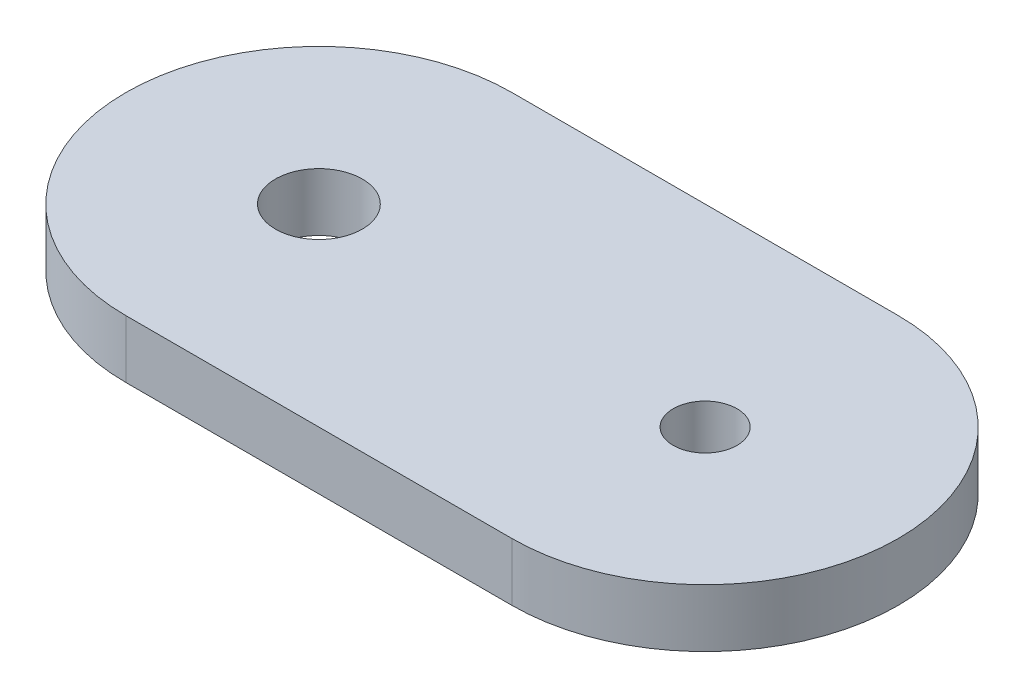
from build123d import *

# Parameters (mm, degrees)
BOSS_EXTRUDE1_DEPTH        = 3
M4_TAPPED_HOLE1_D          = 3.3
F_4_5_4_5_DIAMETER_HOLE1_D = 4.5


with BuildPart() as part:
    # Sketch1 → Boss-Extrude1 (new body)
    with BuildSketch(Plane(origin=(0, 0, 0), x_dir=(1, 0, 0), z_dir=(0, 1, 0))):
        with BuildLine():
            Line((0, 10), (20, 10))
            ThreePointArc((20, 10), (30, 0), (20, -10))
            Line((20, -10), (0, -10))
            ThreePointArc((0, -10), (-10, 0), (0, 10))
        make_face()
    extrude(amount=BOSS_EXTRUDE1_DEPTH)

    # M4 Tapped Hole1 (through all)
    with Locations(Plane(origin=(20, 3, 0), x_dir=(0, 0, 1), z_dir=(0, 1, 0))):
        with Locations((0, 0)):
            Hole(M4_TAPPED_HOLE1_D / 2)

    # 4.5 _4.5_ Diameter Hole1 (through all)
    with Locations(Plane.ZX.offset(3)):
        with Locations((0, 0)):
            Hole(F_4_5_4_5_DIAMETER_HOLE1_D / 2)


solid = part.part
